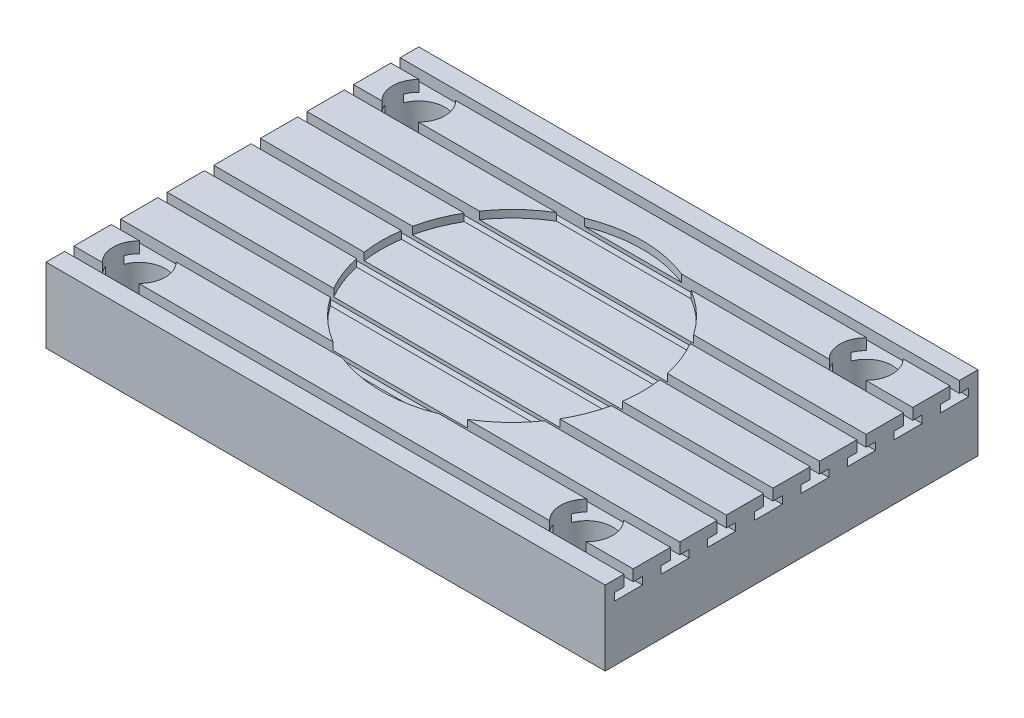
from build123d import *

# Parameters (mm, degrees)
SKETCH1_W                        = 150
SKETCH1_H                        = 100
BOSS_EXTRUDE1_DEPTH              = 20
F_9_16_0_562500_DIAMETER_HOLE1_D = 14
LPATTERN1_COUNT                  = 2
LPATTERN1_PITCH                  = 120
LPATTERN1_COUNT_DIR2             = 2
LPATTERN1_PITCH_DIR2             = 75
CUT_EXTRUDE1_DEPTH               = 160.373774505
LPATTERN2_COUNT                  = 8
LPATTERN2_PITCH                  = 12.5
SKETCH5_R                        = 35
CUT_EXTRUDE2_DEPTH               = 2


with BuildPart() as part:
    # Sketch1 → Boss-Extrude1 (new body)
    with BuildSketch(Plane(origin=(0, 0, 0), x_dir=(1, 0, 0), z_dir=(0, 1, 0))):
        Rectangle(SKETCH1_W, SKETCH1_H)
    extrude(amount=BOSS_EXTRUDE1_DEPTH)

    # 9_16 _0.562500_ Diameter Hole1 (through all)
    with Locations(Plane(origin=(0, 20, 0), x_dir=(-1, 0, 0), z_dir=(0, 1, 0))):
        with Locations((62.5, 37.5)):
            f_9_16_0_562500_diameter_hole1 = Hole(F_9_16_0_562500_DIAMETER_HOLE1_D / 2)

    # LPattern1: 9_16 _0.562500_ Diameter Hole1 2 × 2
    with Locations(*[(i * LPATTERN1_PITCH, 0, -j * LPATTERN1_PITCH_DIR2) for i in range(LPATTERN1_COUNT) for j in range(LPATTERN1_COUNT_DIR2) if (i, j) != (0, 0)]):
        add(f_9_16_0_562500_diameter_hole1, mode=Mode.SUBTRACT)

    # Sketch4 → Cut-Extrude1 (cut, through all)
    with BuildSketch(Plane(origin=(75, 0, 0), x_dir=(0, 0, -1), z_dir=(1, 0, 0))):
        Polygon((-45, 20), (-45, 17), (-47.5, 17), (-47.5, 15), (-40, 15), (-40, 17), (-42.5, 17), (-42.5, 20), align=None)
    cut_extrude1 = extrude(amount=-CUT_EXTRUDE1_DEPTH, mode=Mode.SUBTRACT)

    # LPattern2: Cut-Extrude1 ×8
    with Locations(*[(0, 0, -i * LPATTERN2_PITCH) for i in range(1, LPATTERN2_COUNT)]):
        add(cut_extrude1, mode=Mode.SUBTRACT)

    # Sketch5 → Cut-Extrude2 (cut)
    with BuildSketch(Plane(origin=(0, 20, 0), x_dir=(-1, 0, 0), z_dir=(0, 1, 0))):
        Circle(SKETCH5_R)
    extrude(amount=-CUT_EXTRUDE2_DEPTH, mode=Mode.SUBTRACT)


solid = part.part
